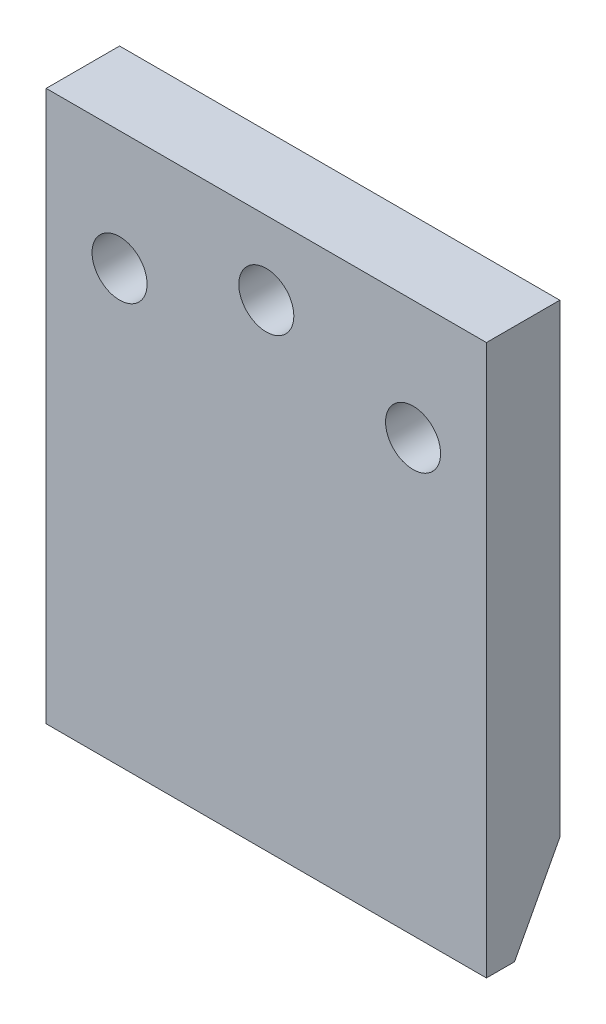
ISO-10303-21;
HEADER;
FILE_DESCRIPTION(('STEP AP214'),'2;1');
FILE_NAME('part.step','',(''),(''),'','','');
FILE_SCHEMA(('AUTOMOTIVE_DESIGN { 1 0 10303 214 1 1 1 1 }'));
ENDSEC;
DATA;
#1=APPLICATION_CONTEXT('core data for automotive mechanical design processes');
#2=APPLICATION_PROTOCOL_DEFINITION('international standard','automotive_design',2000,#1);
#3=PRODUCT_CONTEXT('',#1,'mechanical');
#4=PRODUCT('Part','Part','',(#3));
#5=PRODUCT_RELATED_PRODUCT_CATEGORY('part','',(#4));
#6=PRODUCT_DEFINITION_FORMATION('','',#4);
#7=PRODUCT_DEFINITION_CONTEXT('part definition',#1,'design');
#8=PRODUCT_DEFINITION('design','',#6,#7);
#9=PRODUCT_DEFINITION_SHAPE('','',#8);
#10=(LENGTH_UNIT() NAMED_UNIT(*) SI_UNIT(.MILLI.,.METRE.));
#11=(NAMED_UNIT(*) PLANE_ANGLE_UNIT() SI_UNIT($,.RADIAN.));
#12=(NAMED_UNIT(*) SI_UNIT($,.STERADIAN.) SOLID_ANGLE_UNIT());
#13=UNCERTAINTY_MEASURE_WITH_UNIT(LENGTH_MEASURE(1.E-05),#10,'distance_accuracy_value','');
#14=(GEOMETRIC_REPRESENTATION_CONTEXT(3) GLOBAL_UNCERTAINTY_ASSIGNED_CONTEXT((#13)) GLOBAL_UNIT_ASSIGNED_CONTEXT((#10,
#11,#12)) REPRESENTATION_CONTEXT('',''));
#15=CARTESIAN_POINT('',(0.,0.,0.));
#16=DIRECTION('',(0.,0.,1.));
#17=DIRECTION('',(1.,0.,0.));
#18=AXIS2_PLACEMENT_3D('',#15,#16,#17);
#19=CARTESIAN_POINT('',(38.1,47.625,-12.7));
#20=DIRECTION('',(0.,1.,0.));
#21=DIRECTION('',(-1.,0.,0.));
#22=AXIS2_PLACEMENT_3D('',#19,#20,#21);
#23=PLANE('',#22);
#24=DIRECTION('',(-1.,0.,0.));
#25=VECTOR('',#24,1.);
#26=CARTESIAN_POINT('',(38.1,47.625,0.));
#27=LINE('',#26,#25);
#28=CARTESIAN_POINT('',(38.1,47.625,0.));
#29=VERTEX_POINT('',#28);
#30=CARTESIAN_POINT('',(-38.1,47.625,0.));
#31=VERTEX_POINT('',#30);
#32=EDGE_CURVE('E107',#29,#31,#27,.T.);
#33=ORIENTED_EDGE('',*,*,#32,.F.);
#34=DIRECTION('',(0.,0.,1.));
#35=VECTOR('',#34,1.);
#36=CARTESIAN_POINT('',(38.1,47.625,-12.7));
#37=LINE('',#36,#35);
#38=CARTESIAN_POINT('',(38.1,47.625,-12.7));
#39=VERTEX_POINT('',#38);
#40=EDGE_CURVE('E96',#39,#29,#37,.T.);
#41=ORIENTED_EDGE('',*,*,#40,.F.);
#42=DIRECTION('',(-1.,0.,0.));
#43=VECTOR('',#42,1.);
#44=CARTESIAN_POINT('',(38.1,47.625,-12.7));
#45=LINE('',#44,#43);
#46=CARTESIAN_POINT('',(-38.1,47.625,-12.7));
#47=VERTEX_POINT('',#46);
#48=EDGE_CURVE('E93',#39,#47,#45,.T.);
#49=ORIENTED_EDGE('',*,*,#48,.T.);
#50=DIRECTION('',(0.,0.,1.));
#51=VECTOR('',#50,1.);
#52=CARTESIAN_POINT('',(-38.1,47.625,-12.7));
#53=LINE('',#52,#51);
#54=EDGE_CURVE('E78',#47,#31,#53,.T.);
#55=ORIENTED_EDGE('',*,*,#54,.T.);
#56=EDGE_LOOP('',(#33,#41,#49,#55));
#57=FACE_BOUND('',#56,.T.);
#58=ADVANCED_FACE('F33',(#57),#23,.T.);
#59=CARTESIAN_POINT('',(38.1,47.625,-12.7));
#60=DIRECTION('',(1.,0.,0.));
#61=DIRECTION('',(0.,1.,0.));
#62=AXIS2_PLACEMENT_3D('',#59,#60,#61);
#63=PLANE('',#62);
#64=DIRECTION('',(0.,0.,1.));
#65=VECTOR('',#64,1.);
#66=CARTESIAN_POINT('',(38.1,-47.625,-12.7));
#67=LINE('',#66,#65);
#68=CARTESIAN_POINT('',(38.1,-47.625,-4.86685665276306));
#69=VERTEX_POINT('',#68);
#70=CARTESIAN_POINT('',(38.1,-47.625,0.));
#71=VERTEX_POINT('',#70);
#72=EDGE_CURVE('E115',#69,#71,#67,.T.);
#73=ORIENTED_EDGE('',*,*,#72,.F.);
#74=DIRECTION('',(0.,0.882947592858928,-0.469471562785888));
#75=VECTOR('',#74,1.);
#76=CARTESIAN_POINT('',(38.1,29.878547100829,-46.0762236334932));
#77=LINE('',#76,#75);
#78=CARTESIAN_POINT('',(38.1,-32.8929999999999,-12.7));
#79=VERTEX_POINT('',#78);
#80=EDGE_CURVE('E55',#69,#79,#77,.T.);
#81=ORIENTED_EDGE('',*,*,#80,.T.);
#82=DIRECTION('',(0.,1.,0.));
#83=VECTOR('',#82,1.);
#84=CARTESIAN_POINT('',(38.1,47.625,-12.7));
#85=LINE('',#84,#83);
#86=EDGE_CURVE('E89',#79,#39,#85,.T.);
#87=ORIENTED_EDGE('',*,*,#86,.T.);
#88=ORIENTED_EDGE('',*,*,#40,.T.);
#89=DIRECTION('',(0.,1.,0.));
#90=VECTOR('',#89,1.);
#91=CARTESIAN_POINT('',(38.1,47.625,0.));
#92=LINE('',#91,#90);
#93=EDGE_CURVE('E97',#71,#29,#92,.T.);
#94=ORIENTED_EDGE('',*,*,#93,.F.);
#95=EDGE_LOOP('',(#73,#81,#87,#88,#94));
#96=FACE_BOUND('',#95,.T.);
#97=ADVANCED_FACE('F127',(#96),#63,.T.);
#98=CARTESIAN_POINT('',(38.1,-47.625,-12.7));
#99=DIRECTION('',(0.,-1.,0.));
#100=DIRECTION('',(1.,0.,0.));
#101=AXIS2_PLACEMENT_3D('',#98,#99,#100);
#102=PLANE('',#101);
#103=DIRECTION('',(0.,0.,1.));
#104=VECTOR('',#103,1.);
#105=CARTESIAN_POINT('',(-38.1,-47.625,-12.7));
#106=LINE('',#105,#104);
#107=CARTESIAN_POINT('',(-38.1,-47.625,-4.86685665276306));
#108=VERTEX_POINT('',#107);
#109=CARTESIAN_POINT('',(-38.1,-47.625,0.));
#110=VERTEX_POINT('',#109);
#111=EDGE_CURVE('E88',#108,#110,#106,.T.);
#112=ORIENTED_EDGE('',*,*,#111,.F.);
#113=DIRECTION('',(1.,0.,0.));
#114=VECTOR('',#113,1.);
#115=CARTESIAN_POINT('',(38.1,-47.625,-4.86685665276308));
#116=LINE('',#115,#114);
#117=EDGE_CURVE('E114',#108,#69,#116,.T.);
#118=ORIENTED_EDGE('',*,*,#117,.T.);
#119=ORIENTED_EDGE('',*,*,#72,.T.);
#120=DIRECTION('',(1.,0.,0.));
#121=VECTOR('',#120,1.);
#122=CARTESIAN_POINT('',(38.1,-47.625,0.));
#123=LINE('',#122,#121);
#124=EDGE_CURVE('E100',#110,#71,#123,.T.);
#125=ORIENTED_EDGE('',*,*,#124,.F.);
#126=EDGE_LOOP('',(#112,#118,#119,#125));
#127=FACE_BOUND('',#126,.T.);
#128=ADVANCED_FACE('F123',(#127),#102,.T.);
#129=CARTESIAN_POINT('',(-38.1,47.625,-12.7));
#130=DIRECTION('',(-1.,0.,0.));
#131=DIRECTION('',(0.,-1.,0.));
#132=AXIS2_PLACEMENT_3D('',#129,#130,#131);
#133=PLANE('',#132);
#134=DIRECTION('',(0.,-1.,0.));
#135=VECTOR('',#134,1.);
#136=CARTESIAN_POINT('',(-38.1,47.625,-12.7));
#137=LINE('',#136,#135);
#138=CARTESIAN_POINT('',(-38.1,-32.8929999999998,-12.7));
#139=VERTEX_POINT('',#138);
#140=EDGE_CURVE('E80',#47,#139,#137,.T.);
#141=ORIENTED_EDGE('',*,*,#140,.T.);
#142=DIRECTION('',(0.,-0.882947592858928,0.469471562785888));
#143=VECTOR('',#142,1.);
#144=CARTESIAN_POINT('',(-38.1,29.878547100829,-46.0762236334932));
#145=LINE('',#144,#143);
#146=EDGE_CURVE('E11',#139,#108,#145,.T.);
#147=ORIENTED_EDGE('',*,*,#146,.T.);
#148=ORIENTED_EDGE('',*,*,#111,.T.);
#149=DIRECTION('',(0.,-1.,0.));
#150=VECTOR('',#149,1.);
#151=CARTESIAN_POINT('',(-38.1,47.625,0.));
#152=LINE('',#151,#150);
#153=EDGE_CURVE('E83',#31,#110,#152,.T.);
#154=ORIENTED_EDGE('',*,*,#153,.F.);
#155=ORIENTED_EDGE('',*,*,#54,.F.);
#156=EDGE_LOOP('',(#141,#147,#148,#154,#155));
#157=FACE_BOUND('',#156,.T.);
#158=ADVANCED_FACE('F79',(#157),#133,.T.);
#159=CARTESIAN_POINT('',(0.,0.,-12.7));
#160=DIRECTION('',(0.,0.,1.));
#161=DIRECTION('',(1.,0.,0.));
#162=AXIS2_PLACEMENT_3D('',#159,#160,#161);
#163=PLANE('',#162);
#164=CARTESIAN_POINT('',(25.4,27.0002,-12.7));
#165=DIRECTION('',(0.,0.,1.));
#166=DIRECTION('',(1.,0.,0.));
#167=AXIS2_PLACEMENT_3D('',#164,#165,#166);
#168=CIRCLE('',#167,4.7625);
#169=CARTESIAN_POINT('',(30.1625,27.0002,-12.7));
#170=VERTEX_POINT('',#169);
#171=EDGE_CURVE('E225',#170,#170,#168,.T.);
#172=ORIENTED_EDGE('',*,*,#171,.T.);
#173=EDGE_LOOP('',(#172));
#174=FACE_BOUND('',#173,.T.);
#175=CARTESIAN_POINT('',(0.,34.925,-12.7));
#176=DIRECTION('',(0.,0.,1.));
#177=DIRECTION('',(1.,0.,0.));
#178=AXIS2_PLACEMENT_3D('',#175,#176,#177);
#179=CIRCLE('',#178,4.7625);
#180=CARTESIAN_POINT('',(4.7625,34.925,-12.7));
#181=VERTEX_POINT('',#180);
#182=EDGE_CURVE('E221',#181,#181,#179,.T.);
#183=ORIENTED_EDGE('',*,*,#182,.T.);
#184=EDGE_LOOP('',(#183));
#185=FACE_BOUND('',#184,.T.);
#186=CARTESIAN_POINT('',(-25.4,27.0002,-12.7));
#187=DIRECTION('',(0.,0.,1.));
#188=DIRECTION('',(1.,0.,0.));
#189=AXIS2_PLACEMENT_3D('',#186,#187,#188);
#190=CIRCLE('',#189,4.7625);
#191=CARTESIAN_POINT('',(-20.6375,27.0002,-12.7));
#192=VERTEX_POINT('',#191);
#193=EDGE_CURVE('E109',#192,#192,#190,.T.);
#194=ORIENTED_EDGE('',*,*,#193,.T.);
#195=EDGE_LOOP('',(#194));
#196=FACE_BOUND('',#195,.T.);
#197=ORIENTED_EDGE('',*,*,#86,.F.);
#198=DIRECTION('',(-1.,0.,0.));
#199=VECTOR('',#198,1.);
#200=CARTESIAN_POINT('',(-38.1,-32.8929999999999,-12.7));
#201=LINE('',#200,#199);
#202=EDGE_CURVE('E41',#79,#139,#201,.T.);
#203=ORIENTED_EDGE('',*,*,#202,.T.);
#204=ORIENTED_EDGE('',*,*,#140,.F.);
#205=ORIENTED_EDGE('',*,*,#48,.F.);
#206=EDGE_LOOP('',(#197,#203,#204,#205));
#207=FACE_BOUND('',#206,.T.);
#208=ADVANCED_FACE('F92',(#174,#185,#196,#207),#163,.F.);
#209=CARTESIAN_POINT('',(0.,0.,0.));
#210=DIRECTION('',(0.,0.,1.));
#211=DIRECTION('',(1.,0.,0.));
#212=AXIS2_PLACEMENT_3D('',#209,#210,#211);
#213=PLANE('',#212);
#214=CARTESIAN_POINT('',(25.4,27.0002,0.));
#215=DIRECTION('',(0.,0.,1.));
#216=DIRECTION('',(1.,0.,0.));
#217=AXIS2_PLACEMENT_3D('',#214,#215,#216);
#218=CIRCLE('',#217,4.7625);
#219=CARTESIAN_POINT('',(30.1625,27.0002,0.));
#220=VERTEX_POINT('',#219);
#221=EDGE_CURVE('E229',#220,#220,#218,.T.);
#222=ORIENTED_EDGE('',*,*,#221,.F.);
#223=EDGE_LOOP('',(#222));
#224=FACE_BOUND('',#223,.T.);
#225=CARTESIAN_POINT('',(0.,34.925,0.));
#226=DIRECTION('',(0.,0.,1.));
#227=DIRECTION('',(1.,0.,0.));
#228=AXIS2_PLACEMENT_3D('',#225,#226,#227);
#229=CIRCLE('',#228,4.7625);
#230=CARTESIAN_POINT('',(4.7625,34.925,0.));
#231=VERTEX_POINT('',#230);
#232=EDGE_CURVE('E224',#231,#231,#229,.T.);
#233=ORIENTED_EDGE('',*,*,#232,.F.);
#234=EDGE_LOOP('',(#233));
#235=FACE_BOUND('',#234,.T.);
#236=CARTESIAN_POINT('',(-25.4,27.0002,0.));
#237=DIRECTION('',(0.,0.,1.));
#238=DIRECTION('',(1.,0.,0.));
#239=AXIS2_PLACEMENT_3D('',#236,#237,#238);
#240=CIRCLE('',#239,4.7625);
#241=CARTESIAN_POINT('',(-20.6375,27.0002,0.));
#242=VERTEX_POINT('',#241);
#243=EDGE_CURVE('E103',#242,#242,#240,.T.);
#244=ORIENTED_EDGE('',*,*,#243,.F.);
#245=EDGE_LOOP('',(#244));
#246=FACE_BOUND('',#245,.T.);
#247=ORIENTED_EDGE('',*,*,#32,.T.);
#248=ORIENTED_EDGE('',*,*,#153,.T.);
#249=ORIENTED_EDGE('',*,*,#124,.T.);
#250=ORIENTED_EDGE('',*,*,#93,.T.);
#251=EDGE_LOOP('',(#247,#248,#249,#250));
#252=FACE_BOUND('',#251,.T.);
#253=ADVANCED_FACE('F129',(#224,#235,#246,#252),#213,.T.);
#254=CARTESIAN_POINT('',(-25.4,27.0002,-12.7));
#255=DIRECTION('',(0.,0.,1.));
#256=DIRECTION('',(1.,0.,0.));
#257=AXIS2_PLACEMENT_3D('',#254,#255,#256);
#258=CYLINDRICAL_SURFACE('',#257,4.7625);
#259=ORIENTED_EDGE('',*,*,#193,.F.);
#260=EDGE_LOOP('',(#259));
#261=FACE_BOUND('',#260,.T.);
#262=ORIENTED_EDGE('',*,*,#243,.T.);
#263=EDGE_LOOP('',(#262));
#264=FACE_BOUND('',#263,.T.);
#265=ADVANCED_FACE('F131',(#261,#264),#258,.F.);
#266=CARTESIAN_POINT('',(0.,34.925,-12.7));
#267=DIRECTION('',(0.,0.,1.));
#268=DIRECTION('',(1.,0.,0.));
#269=AXIS2_PLACEMENT_3D('',#266,#267,#268);
#270=CYLINDRICAL_SURFACE('',#269,4.7625);
#271=ORIENTED_EDGE('',*,*,#182,.F.);
#272=EDGE_LOOP('',(#271));
#273=FACE_BOUND('',#272,.T.);
#274=ORIENTED_EDGE('',*,*,#232,.T.);
#275=EDGE_LOOP('',(#274));
#276=FACE_BOUND('',#275,.T.);
#277=ADVANCED_FACE('F138',(#273,#276),#270,.F.);
#278=CARTESIAN_POINT('',(25.4,27.0002,-12.7));
#279=DIRECTION('',(0.,0.,1.));
#280=DIRECTION('',(1.,0.,0.));
#281=AXIS2_PLACEMENT_3D('',#278,#279,#280);
#282=CYLINDRICAL_SURFACE('',#281,4.7625);
#283=ORIENTED_EDGE('',*,*,#171,.F.);
#284=EDGE_LOOP('',(#283));
#285=FACE_BOUND('',#284,.T.);
#286=ORIENTED_EDGE('',*,*,#221,.T.);
#287=EDGE_LOOP('',(#286));
#288=FACE_BOUND('',#287,.T.);
#289=ADVANCED_FACE('F173',(#285,#288),#282,.F.);
#290=CARTESIAN_POINT('',(38.1,-47.625,-4.86685665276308));
#291=DIRECTION('',(0.,-0.469471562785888,-0.882947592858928));
#292=DIRECTION('',(-1.,0.,0.));
#293=AXIS2_PLACEMENT_3D('',#290,#291,#292);
#294=PLANE('',#293);
#295=ORIENTED_EDGE('',*,*,#146,.F.);
#296=ORIENTED_EDGE('',*,*,#202,.F.);
#297=ORIENTED_EDGE('',*,*,#80,.F.);
#298=ORIENTED_EDGE('',*,*,#117,.F.);
#299=EDGE_LOOP('',(#295,#296,#297,#298));
#300=FACE_BOUND('',#299,.T.);
#301=ADVANCED_FACE('F35',(#300),#294,.T.);
#302=CLOSED_SHELL('',(#58,#97,#128,#158,#208,#253,#265,#277,#289,#301));
#303=MANIFOLD_SOLID_BREP('B2',#302);
#304=ADVANCED_BREP_SHAPE_REPRESENTATION('',(#18,#303),#14);
#305=SHAPE_DEFINITION_REPRESENTATION(#9,#304);
ENDSEC;
END-ISO-10303-21;
